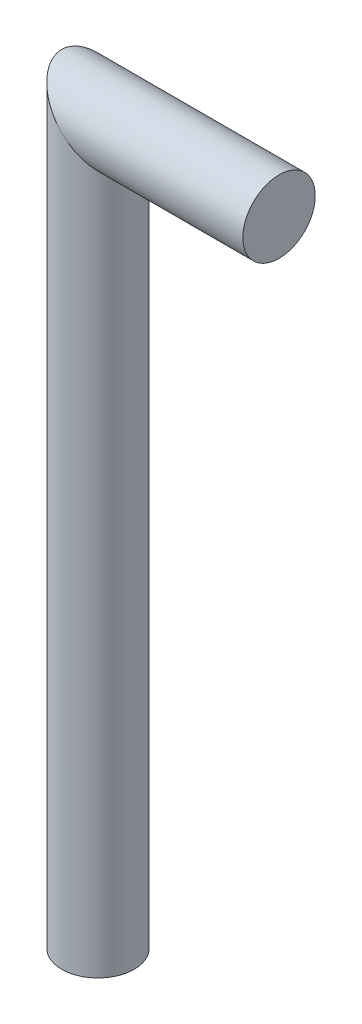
from build123d import *

# Parameters (mm, degrees)
CROQUIS1_R = 6


with BuildPart() as part:
    # Barrer1: sweep along a path in Croquis2
    with BuildLine(Plane.XY) as barrer1_path:
        Line((0, 0), (0, 120))
        Line((0, 120), (30, 120))
    # Croquis1 → Barrer1 (sweep)
    with BuildSketch(Plane(origin=(0, 0, 0), x_dir=(1, 0, 0), z_dir=(0, 1, 0))):
        Circle(CROQUIS1_R)
    sweep(path=barrer1_path.line, transition=Transition.RIGHT)


solid = part.part
